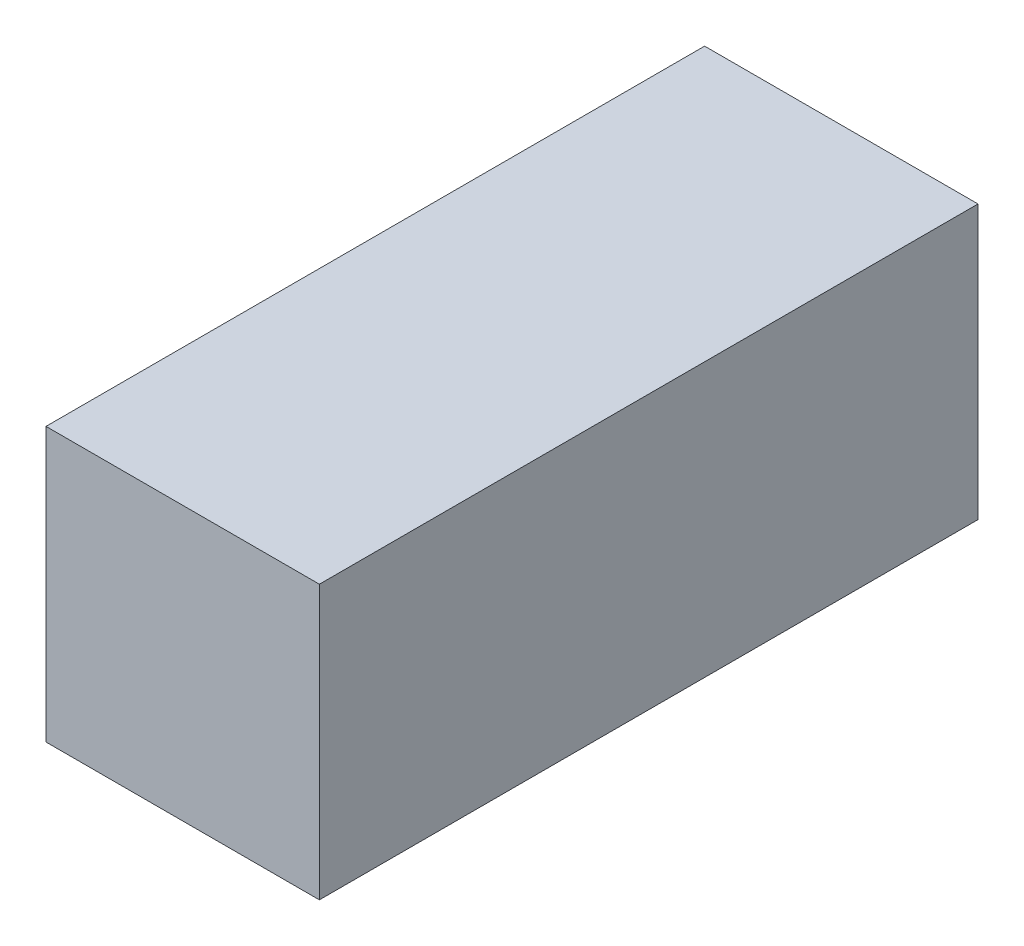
from build123d import *

# Parameters (mm, degrees)
ESQUISSE1_W      = 55
ESQUISSE1_H      = 55
EXTRUSION1_DEPTH = 132.5


with BuildPart() as part:
    # Esquisse1 → Extrusion1 (new body)
    with BuildSketch(Plane.XY):
        with Locations((27.5, 27.5)):
            Rectangle(ESQUISSE1_W, ESQUISSE1_H)
    extrude(amount=EXTRUSION1_DEPTH)


solid = part.part
